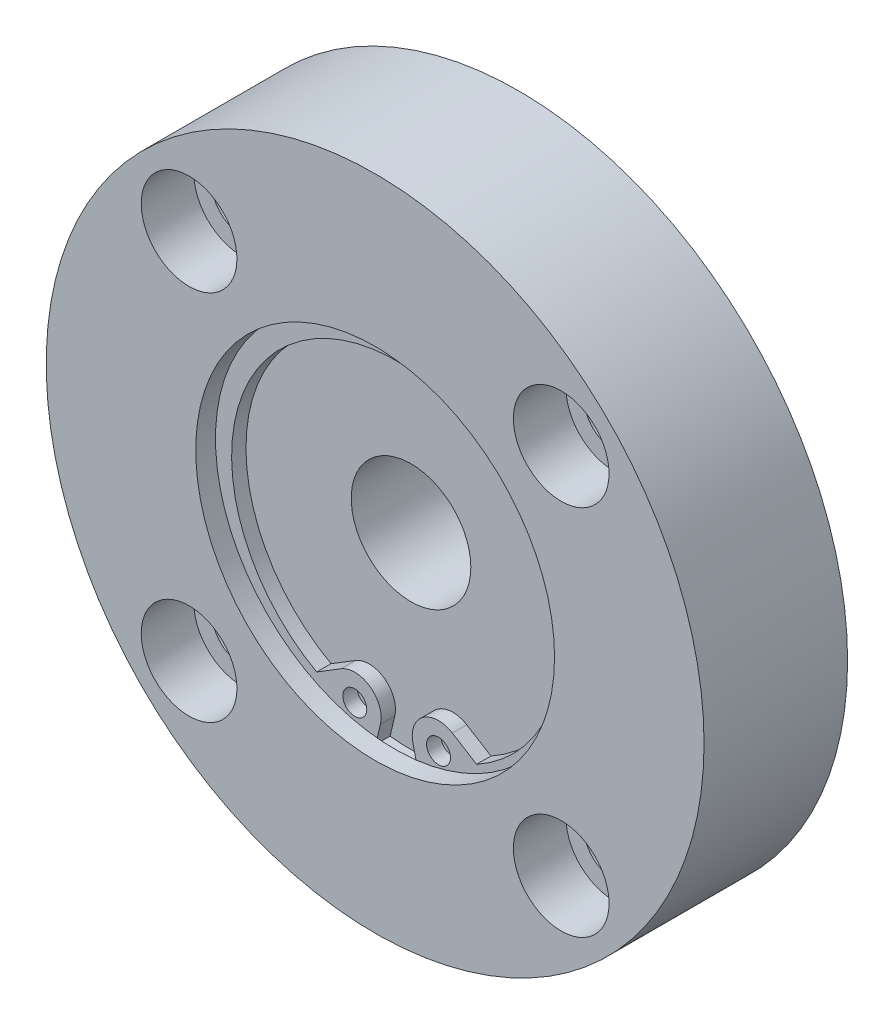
ISO-10303-21;
HEADER;
FILE_DESCRIPTION(('STEP AP214'),'2;1');
FILE_NAME('part.step','',(''),(''),'','','');
FILE_SCHEMA(('AUTOMOTIVE_DESIGN { 1 0 10303 214 1 1 1 1 }'));
ENDSEC;
DATA;
#1=APPLICATION_CONTEXT('core data for automotive mechanical design processes');
#2=APPLICATION_PROTOCOL_DEFINITION('international standard','automotive_design',2000,#1);
#3=PRODUCT_CONTEXT('',#1,'mechanical');
#4=PRODUCT('Part','Part','',(#3));
#5=PRODUCT_RELATED_PRODUCT_CATEGORY('part','',(#4));
#6=PRODUCT_DEFINITION_FORMATION('','',#4);
#7=PRODUCT_DEFINITION_CONTEXT('part definition',#1,'design');
#8=PRODUCT_DEFINITION('design','',#6,#7);
#9=PRODUCT_DEFINITION_SHAPE('','',#8);
#10=(LENGTH_UNIT() NAMED_UNIT(*) SI_UNIT(.MILLI.,.METRE.));
#11=(NAMED_UNIT(*) PLANE_ANGLE_UNIT() SI_UNIT($,.RADIAN.));
#12=(NAMED_UNIT(*) SI_UNIT($,.STERADIAN.) SOLID_ANGLE_UNIT());
#13=UNCERTAINTY_MEASURE_WITH_UNIT(LENGTH_MEASURE(1.E-05),#10,'distance_accuracy_value','');
#14=(GEOMETRIC_REPRESENTATION_CONTEXT(3) GLOBAL_UNCERTAINTY_ASSIGNED_CONTEXT((#13)) GLOBAL_UNIT_ASSIGNED_CONTEXT((#10,
#11,#12)) REPRESENTATION_CONTEXT('',''));
#15=CARTESIAN_POINT('',(0.,0.,0.));
#16=DIRECTION('',(0.,0.,1.));
#17=DIRECTION('',(1.,0.,0.));
#18=AXIS2_PLACEMENT_3D('',#15,#16,#17);
#19=CARTESIAN_POINT('',(15.556349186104,15.5563491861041,0.));
#20=DIRECTION('',(0.,0.,1.));
#21=DIRECTION('',(1.,0.,0.));
#22=AXIS2_PLACEMENT_3D('',#19,#20,#21);
#23=CYLINDRICAL_SURFACE('',#22,2.5);
#24=CARTESIAN_POINT('',(15.556349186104,15.5563491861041,0.));
#25=DIRECTION('',(0.,0.,1.));
#26=DIRECTION('',(1.,0.,0.));
#27=AXIS2_PLACEMENT_3D('',#24,#25,#26);
#28=CIRCLE('',#27,2.5);
#29=CARTESIAN_POINT('',(18.056349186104,15.5563491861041,0.));
#30=VERTEX_POINT('',#29);
#31=EDGE_CURVE('E206',#30,#30,#28,.T.);
#32=ORIENTED_EDGE('',*,*,#31,.F.);
#33=EDGE_LOOP('',(#32));
#34=FACE_BOUND('',#33,.T.);
#35=CARTESIAN_POINT('',(15.556349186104,15.5563491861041,7.6));
#36=DIRECTION('',(0.,0.,1.));
#37=DIRECTION('',(1.,0.,0.));
#38=AXIS2_PLACEMENT_3D('',#35,#36,#37);
#39=CIRCLE('',#38,2.5);
#40=CARTESIAN_POINT('',(18.056349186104,15.5563491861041,7.6));
#41=VERTEX_POINT('',#40);
#42=EDGE_CURVE('E203',#41,#41,#39,.F.);
#43=ORIENTED_EDGE('',*,*,#42,.F.);
#44=EDGE_LOOP('',(#43));
#45=FACE_BOUND('',#44,.T.);
#46=ADVANCED_FACE('F14',(#34,#45),#23,.F.);
#47=CARTESIAN_POINT('',(15.556349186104,-15.556349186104,0.));
#48=DIRECTION('',(0.,0.,1.));
#49=DIRECTION('',(1.,0.,0.));
#50=AXIS2_PLACEMENT_3D('',#47,#48,#49);
#51=CYLINDRICAL_SURFACE('',#50,2.5);
#52=CARTESIAN_POINT('',(15.556349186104,-15.556349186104,0.));
#53=DIRECTION('',(0.,0.,1.));
#54=DIRECTION('',(0.,-1.,0.));
#55=AXIS2_PLACEMENT_3D('',#52,#53,#54);
#56=CIRCLE('',#55,2.5);
#57=CARTESIAN_POINT('',(15.556349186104,-18.056349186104,0.));
#58=VERTEX_POINT('',#57);
#59=EDGE_CURVE('E224',#58,#58,#56,.T.);
#60=ORIENTED_EDGE('',*,*,#59,.F.);
#61=EDGE_LOOP('',(#60));
#62=FACE_BOUND('',#61,.T.);
#63=CARTESIAN_POINT('',(15.556349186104,-15.556349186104,7.6));
#64=DIRECTION('',(0.,0.,1.));
#65=DIRECTION('',(1.,0.,0.));
#66=AXIS2_PLACEMENT_3D('',#63,#64,#65);
#67=CIRCLE('',#66,2.5);
#68=CARTESIAN_POINT('',(18.056349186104,-15.556349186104,7.6));
#69=VERTEX_POINT('',#68);
#70=EDGE_CURVE('E198',#69,#69,#67,.F.);
#71=ORIENTED_EDGE('',*,*,#70,.F.);
#72=EDGE_LOOP('',(#71));
#73=FACE_BOUND('',#72,.T.);
#74=ADVANCED_FACE('F326',(#62,#73),#51,.F.);
#75=CARTESIAN_POINT('',(-15.5563491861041,-15.556349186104,0.));
#76=DIRECTION('',(0.,0.,1.));
#77=DIRECTION('',(1.,0.,0.));
#78=AXIS2_PLACEMENT_3D('',#75,#76,#77);
#79=CYLINDRICAL_SURFACE('',#78,2.5);
#80=CARTESIAN_POINT('',(-15.5563491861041,-15.556349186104,0.));
#81=DIRECTION('',(0.,0.,1.));
#82=DIRECTION('',(-1.,0.,0.));
#83=AXIS2_PLACEMENT_3D('',#80,#81,#82);
#84=CIRCLE('',#83,2.5);
#85=CARTESIAN_POINT('',(-18.0563491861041,-15.556349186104,0.));
#86=VERTEX_POINT('',#85);
#87=EDGE_CURVE('E227',#86,#86,#84,.T.);
#88=ORIENTED_EDGE('',*,*,#87,.F.);
#89=EDGE_LOOP('',(#88));
#90=FACE_BOUND('',#89,.T.);
#91=CARTESIAN_POINT('',(-15.5563491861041,-15.556349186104,7.6));
#92=DIRECTION('',(0.,0.,1.));
#93=DIRECTION('',(1.,0.,0.));
#94=AXIS2_PLACEMENT_3D('',#91,#92,#93);
#95=CIRCLE('',#94,2.5);
#96=CARTESIAN_POINT('',(-13.0563491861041,-15.556349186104,7.6));
#97=VERTEX_POINT('',#96);
#98=EDGE_CURVE('E193',#97,#97,#95,.F.);
#99=ORIENTED_EDGE('',*,*,#98,.F.);
#100=EDGE_LOOP('',(#99));
#101=FACE_BOUND('',#100,.T.);
#102=ADVANCED_FACE('F319',(#90,#101),#79,.F.);
#103=CARTESIAN_POINT('',(-15.556349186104,15.5563491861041,0.));
#104=DIRECTION('',(0.,0.,1.));
#105=DIRECTION('',(1.,0.,0.));
#106=AXIS2_PLACEMENT_3D('',#103,#104,#105);
#107=CYLINDRICAL_SURFACE('',#106,2.5);
#108=CARTESIAN_POINT('',(-15.556349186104,15.5563491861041,0.));
#109=DIRECTION('',(0.,0.,1.));
#110=DIRECTION('',(0.,1.,0.));
#111=AXIS2_PLACEMENT_3D('',#108,#109,#110);
#112=CIRCLE('',#111,2.5);
#113=CARTESIAN_POINT('',(-15.5563491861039,18.0563491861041,0.));
#114=VERTEX_POINT('',#113);
#115=EDGE_CURVE('E201',#114,#114,#112,.T.);
#116=ORIENTED_EDGE('',*,*,#115,.F.);
#117=EDGE_LOOP('',(#116));
#118=FACE_BOUND('',#117,.T.);
#119=CARTESIAN_POINT('',(-15.556349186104,15.5563491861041,7.6));
#120=DIRECTION('',(0.,0.,1.));
#121=DIRECTION('',(1.,0.,0.));
#122=AXIS2_PLACEMENT_3D('',#119,#120,#121);
#123=CIRCLE('',#122,2.5);
#124=CARTESIAN_POINT('',(-13.056349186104,15.5563491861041,7.6));
#125=VERTEX_POINT('',#124);
#126=EDGE_CURVE('E188',#125,#125,#123,.F.);
#127=ORIENTED_EDGE('',*,*,#126,.F.);
#128=EDGE_LOOP('',(#127));
#129=FACE_BOUND('',#128,.T.);
#130=ADVANCED_FACE('F312',(#118,#129),#107,.F.);
#131=CARTESIAN_POINT('',(0.,0.,-5.));
#132=DIRECTION('',(0.,0.,1.));
#133=DIRECTION('',(1.,0.,0.));
#134=AXIS2_PLACEMENT_3D('',#131,#132,#133);
#135=CYLINDRICAL_SURFACE('',#134,18.);
#136=CARTESIAN_POINT('',(0.,0.,-5.));
#137=DIRECTION('',(0.,0.,-1.));
#138=DIRECTION('',(-1.,0.,0.));
#139=AXIS2_PLACEMENT_3D('',#136,#137,#138);
#140=CIRCLE('',#139,18.);
#141=CARTESIAN_POINT('',(-18.,0.,-5.));
#142=VERTEX_POINT('',#141);
#143=EDGE_CURVE('E246',#142,#142,#140,.T.);
#144=ORIENTED_EDGE('',*,*,#143,.F.);
#145=EDGE_LOOP('',(#144));
#146=FACE_BOUND('',#145,.T.);
#147=CARTESIAN_POINT('',(0.,0.,0.));
#148=DIRECTION('',(0.,0.,-1.));
#149=DIRECTION('',(-1.,0.,0.));
#150=AXIS2_PLACEMENT_3D('',#147,#148,#149);
#151=CIRCLE('',#150,18.);
#152=CARTESIAN_POINT('',(-18.,0.,0.));
#153=VERTEX_POINT('',#152);
#154=EDGE_CURVE('E177',#153,#153,#151,.T.);
#155=ORIENTED_EDGE('',*,*,#154,.T.);
#156=EDGE_LOOP('',(#155));
#157=FACE_BOUND('',#156,.T.);
#158=ADVANCED_FACE('F306',(#146,#157),#135,.T.);
#159=CARTESIAN_POINT('',(0.,0.,0.));
#160=DIRECTION('',(0.,0.,1.));
#161=DIRECTION('',(1.,0.,0.));
#162=AXIS2_PLACEMENT_3D('',#159,#160,#161);
#163=PLANE('',#162);
#164=ORIENTED_EDGE('',*,*,#115,.T.);
#165=EDGE_LOOP('',(#164));
#166=FACE_BOUND('',#165,.T.);
#167=ORIENTED_EDGE('',*,*,#87,.T.);
#168=EDGE_LOOP('',(#167));
#169=FACE_BOUND('',#168,.T.);
#170=ORIENTED_EDGE('',*,*,#59,.T.);
#171=EDGE_LOOP('',(#170));
#172=FACE_BOUND('',#171,.T.);
#173=ORIENTED_EDGE('',*,*,#31,.T.);
#174=EDGE_LOOP('',(#173));
#175=FACE_BOUND('',#174,.T.);
#176=CARTESIAN_POINT('',(0.,0.,0.));
#177=DIRECTION('',(0.,0.,1.));
#178=DIRECTION('',(1.,0.,0.));
#179=AXIS2_PLACEMENT_3D('',#176,#177,#178);
#180=CIRCLE('',#179,27.5);
#181=CARTESIAN_POINT('',(27.5,0.,0.));
#182=VERTEX_POINT('',#181);
#183=EDGE_CURVE('E211',#182,#182,#180,.T.);
#184=ORIENTED_EDGE('',*,*,#183,.F.);
#185=EDGE_LOOP('',(#184));
#186=FACE_BOUND('',#185,.T.);
#187=ORIENTED_EDGE('',*,*,#154,.F.);
#188=EDGE_LOOP('',(#187));
#189=FACE_BOUND('',#188,.T.);
#190=ADVANCED_FACE('F302',(#166,#169,#172,#175,#186,#189),#163,.F.);
#191=CARTESIAN_POINT('',(15.556349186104,15.5563491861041,7.6));
#192=DIRECTION('',(0.,0.,1.));
#193=DIRECTION('',(1.,0.,0.));
#194=AXIS2_PLACEMENT_3D('',#191,#192,#193);
#195=PLANE('',#194);
#196=CARTESIAN_POINT('',(15.556349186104,15.5563491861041,7.6));
#197=DIRECTION('',(0.,0.,1.));
#198=DIRECTION('',(1.,0.,0.));
#199=AXIS2_PLACEMENT_3D('',#196,#197,#198);
#200=CIRCLE('',#199,4.);
#201=CARTESIAN_POINT('',(19.556349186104,15.5563491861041,7.6));
#202=VERTEX_POINT('',#201);
#203=EDGE_CURVE('E207',#202,#202,#200,.T.);
#204=ORIENTED_EDGE('',*,*,#203,.T.);
#205=EDGE_LOOP('',(#204));
#206=FACE_BOUND('',#205,.T.);
#207=ORIENTED_EDGE('',*,*,#42,.T.);
#208=EDGE_LOOP('',(#207));
#209=FACE_BOUND('',#208,.T.);
#210=ADVANCED_FACE('F305',(#206,#209),#195,.T.);
#211=CARTESIAN_POINT('',(15.556349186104,-15.556349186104,7.6));
#212=DIRECTION('',(0.,0.,1.));
#213=DIRECTION('',(0.,-1.,0.));
#214=AXIS2_PLACEMENT_3D('',#211,#212,#213);
#215=PLANE('',#214);
#216=CARTESIAN_POINT('',(15.556349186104,-15.556349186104,7.6));
#217=DIRECTION('',(0.,0.,1.));
#218=DIRECTION('',(0.,-1.,0.));
#219=AXIS2_PLACEMENT_3D('',#216,#217,#218);
#220=CIRCLE('',#219,4.);
#221=CARTESIAN_POINT('',(15.556349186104,-19.556349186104,7.6));
#222=VERTEX_POINT('',#221);
#223=EDGE_CURVE('E202',#222,#222,#220,.T.);
#224=ORIENTED_EDGE('',*,*,#223,.T.);
#225=EDGE_LOOP('',(#224));
#226=FACE_BOUND('',#225,.T.);
#227=ORIENTED_EDGE('',*,*,#70,.T.);
#228=EDGE_LOOP('',(#227));
#229=FACE_BOUND('',#228,.T.);
#230=ADVANCED_FACE('F640',(#226,#229),#215,.T.);
#231=CARTESIAN_POINT('',(-15.5563491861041,-15.556349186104,7.6));
#232=DIRECTION('',(0.,0.,1.));
#233=DIRECTION('',(-1.,0.,0.));
#234=AXIS2_PLACEMENT_3D('',#231,#232,#233);
#235=PLANE('',#234);
#236=CARTESIAN_POINT('',(-15.5563491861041,-15.556349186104,7.6));
#237=DIRECTION('',(0.,0.,1.));
#238=DIRECTION('',(-1.,0.,0.));
#239=AXIS2_PLACEMENT_3D('',#236,#237,#238);
#240=CIRCLE('',#239,4.);
#241=CARTESIAN_POINT('',(-19.5563491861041,-15.556349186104,7.6));
#242=VERTEX_POINT('',#241);
#243=EDGE_CURVE('E197',#242,#242,#240,.T.);
#244=ORIENTED_EDGE('',*,*,#243,.T.);
#245=EDGE_LOOP('',(#244));
#246=FACE_BOUND('',#245,.T.);
#247=ORIENTED_EDGE('',*,*,#98,.T.);
#248=EDGE_LOOP('',(#247));
#249=FACE_BOUND('',#248,.T.);
#250=ADVANCED_FACE('F431',(#246,#249),#235,.T.);
#251=CARTESIAN_POINT('',(-15.556349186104,15.5563491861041,7.6));
#252=DIRECTION('',(0.,0.,1.));
#253=DIRECTION('',(0.,1.,0.));
#254=AXIS2_PLACEMENT_3D('',#251,#252,#253);
#255=PLANE('',#254);
#256=CARTESIAN_POINT('',(-15.556349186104,15.5563491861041,7.6));
#257=DIRECTION('',(0.,0.,1.));
#258=DIRECTION('',(0.,1.,0.));
#259=AXIS2_PLACEMENT_3D('',#256,#257,#258);
#260=CIRCLE('',#259,4.);
#261=CARTESIAN_POINT('',(-15.5563491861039,19.5563491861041,7.6));
#262=VERTEX_POINT('',#261);
#263=EDGE_CURVE('E192',#262,#262,#260,.T.);
#264=ORIENTED_EDGE('',*,*,#263,.T.);
#265=EDGE_LOOP('',(#264));
#266=FACE_BOUND('',#265,.T.);
#267=ORIENTED_EDGE('',*,*,#126,.T.);
#268=EDGE_LOOP('',(#267));
#269=FACE_BOUND('',#268,.T.);
#270=ADVANCED_FACE('F426',(#266,#269),#255,.T.);
#271=CARTESIAN_POINT('',(0.,0.,-5.));
#272=DIRECTION('',(0.,0.,-1.));
#273=DIRECTION('',(-1.,0.,0.));
#274=AXIS2_PLACEMENT_3D('',#271,#272,#273);
#275=PLANE('',#274);
#276=ORIENTED_EDGE('',*,*,#143,.T.);
#277=EDGE_LOOP('',(#276));
#278=FACE_BOUND('',#277,.T.);
#279=CARTESIAN_POINT('',(0.,0.,-5.));
#280=DIRECTION('',(0.,0.,-1.));
#281=DIRECTION('',(-1.,0.,0.));
#282=AXIS2_PLACEMENT_3D('',#279,#280,#281);
#283=CIRCLE('',#282,12.);
#284=CARTESIAN_POINT('',(-12.,0.,-5.));
#285=VERTEX_POINT('',#284);
#286=EDGE_CURVE('E249',#285,#285,#283,.T.);
#287=ORIENTED_EDGE('',*,*,#286,.F.);
#288=EDGE_LOOP('',(#287));
#289=FACE_BOUND('',#288,.T.);
#290=ADVANCED_FACE('F298',(#278,#289),#275,.T.);
#291=CARTESIAN_POINT('',(0.,0.,12.));
#292=DIRECTION('',(0.,0.,-1.));
#293=DIRECTION('',(-1.,0.,0.));
#294=AXIS2_PLACEMENT_3D('',#291,#292,#293);
#295=CYLINDRICAL_SURFACE('',#294,27.5);
#296=CARTESIAN_POINT('',(0.,0.,12.));
#297=DIRECTION('',(0.,0.,1.));
#298=DIRECTION('',(1.,0.,0.));
#299=AXIS2_PLACEMENT_3D('',#296,#297,#298);
#300=CIRCLE('',#299,27.5);
#301=CARTESIAN_POINT('',(27.5,0.,12.));
#302=VERTEX_POINT('',#301);
#303=EDGE_CURVE('E208',#302,#302,#300,.T.);
#304=ORIENTED_EDGE('',*,*,#303,.F.);
#305=EDGE_LOOP('',(#304));
#306=FACE_BOUND('',#305,.T.);
#307=ORIENTED_EDGE('',*,*,#183,.T.);
#308=EDGE_LOOP('',(#307));
#309=FACE_BOUND('',#308,.T.);
#310=ADVANCED_FACE('F294',(#306,#309),#295,.T.);
#311=CARTESIAN_POINT('',(15.556349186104,15.5563491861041,7.6));
#312=DIRECTION('',(0.,0.,1.));
#313=DIRECTION('',(1.,0.,0.));
#314=AXIS2_PLACEMENT_3D('',#311,#312,#313);
#315=CYLINDRICAL_SURFACE('',#314,4.);
#316=ORIENTED_EDGE('',*,*,#203,.F.);
#317=EDGE_LOOP('',(#316));
#318=FACE_BOUND('',#317,.T.);
#319=CARTESIAN_POINT('',(15.556349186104,15.5563491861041,12.));
#320=DIRECTION('',(0.,0.,1.));
#321=DIRECTION('',(1.,0.,0.));
#322=AXIS2_PLACEMENT_3D('',#319,#320,#321);
#323=CIRCLE('',#322,4.);
#324=CARTESIAN_POINT('',(19.556349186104,15.5563491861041,12.));
#325=VERTEX_POINT('',#324);
#326=EDGE_CURVE('E221',#325,#325,#323,.T.);
#327=ORIENTED_EDGE('',*,*,#326,.T.);
#328=EDGE_LOOP('',(#327));
#329=FACE_BOUND('',#328,.T.);
#330=ADVANCED_FACE('F297',(#318,#329),#315,.F.);
#331=CARTESIAN_POINT('',(15.556349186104,-15.556349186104,7.6));
#332=DIRECTION('',(0.,0.,1.));
#333=DIRECTION('',(1.,0.,0.));
#334=AXIS2_PLACEMENT_3D('',#331,#332,#333);
#335=CYLINDRICAL_SURFACE('',#334,4.);
#336=ORIENTED_EDGE('',*,*,#223,.F.);
#337=EDGE_LOOP('',(#336));
#338=FACE_BOUND('',#337,.T.);
#339=CARTESIAN_POINT('',(15.556349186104,-15.556349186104,12.));
#340=DIRECTION('',(0.,0.,1.));
#341=DIRECTION('',(0.,-1.,0.));
#342=AXIS2_PLACEMENT_3D('',#339,#340,#341);
#343=CIRCLE('',#342,4.);
#344=CARTESIAN_POINT('',(15.556349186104,-19.556349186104,12.));
#345=VERTEX_POINT('',#344);
#346=EDGE_CURVE('E196',#345,#345,#343,.T.);
#347=ORIENTED_EDGE('',*,*,#346,.T.);
#348=EDGE_LOOP('',(#347));
#349=FACE_BOUND('',#348,.T.);
#350=ADVANCED_FACE('F649',(#338,#349),#335,.F.);
#351=CARTESIAN_POINT('',(-15.5563491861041,-15.556349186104,7.6));
#352=DIRECTION('',(0.,0.,1.));
#353=DIRECTION('',(1.,0.,0.));
#354=AXIS2_PLACEMENT_3D('',#351,#352,#353);
#355=CYLINDRICAL_SURFACE('',#354,4.);
#356=ORIENTED_EDGE('',*,*,#243,.F.);
#357=EDGE_LOOP('',(#356));
#358=FACE_BOUND('',#357,.T.);
#359=CARTESIAN_POINT('',(-15.5563491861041,-15.556349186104,12.));
#360=DIRECTION('',(0.,0.,1.));
#361=DIRECTION('',(-1.,0.,0.));
#362=AXIS2_PLACEMENT_3D('',#359,#360,#361);
#363=CIRCLE('',#362,4.);
#364=CARTESIAN_POINT('',(-19.5563491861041,-15.556349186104,12.));
#365=VERTEX_POINT('',#364);
#366=EDGE_CURVE('E191',#365,#365,#363,.T.);
#367=ORIENTED_EDGE('',*,*,#366,.T.);
#368=EDGE_LOOP('',(#367));
#369=FACE_BOUND('',#368,.T.);
#370=ADVANCED_FACE('F631',(#358,#369),#355,.F.);
#371=CARTESIAN_POINT('',(-15.556349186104,15.5563491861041,7.6));
#372=DIRECTION('',(0.,0.,1.));
#373=DIRECTION('',(1.,0.,0.));
#374=AXIS2_PLACEMENT_3D('',#371,#372,#373);
#375=CYLINDRICAL_SURFACE('',#374,4.);
#376=ORIENTED_EDGE('',*,*,#263,.F.);
#377=EDGE_LOOP('',(#376));
#378=FACE_BOUND('',#377,.T.);
#379=CARTESIAN_POINT('',(-15.556349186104,15.5563491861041,12.));
#380=DIRECTION('',(0.,0.,1.));
#381=DIRECTION('',(0.,1.,0.));
#382=AXIS2_PLACEMENT_3D('',#379,#380,#381);
#383=CIRCLE('',#382,4.);
#384=CARTESIAN_POINT('',(-15.5563491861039,19.5563491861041,12.));
#385=VERTEX_POINT('',#384);
#386=EDGE_CURVE('E186',#385,#385,#383,.T.);
#387=ORIENTED_EDGE('',*,*,#386,.T.);
#388=EDGE_LOOP('',(#387));
#389=FACE_BOUND('',#388,.T.);
#390=ADVANCED_FACE('F423',(#378,#389),#375,.F.);
#391=CARTESIAN_POINT('',(0.,0.,-5.));
#392=DIRECTION('',(0.,0.,1.));
#393=DIRECTION('',(1.,0.,0.));
#394=AXIS2_PLACEMENT_3D('',#391,#392,#393);
#395=CYLINDRICAL_SURFACE('',#394,12.);
#396=ORIENTED_EDGE('',*,*,#286,.T.);
#397=EDGE_LOOP('',(#396));
#398=FACE_BOUND('',#397,.T.);
#399=CARTESIAN_POINT('',(0.,0.,0.));
#400=DIRECTION('',(0.,0.,-1.));
#401=DIRECTION('',(-1.,0.,0.));
#402=AXIS2_PLACEMENT_3D('',#399,#400,#401);
#403=CIRCLE('',#402,12.);
#404=CARTESIAN_POINT('',(-12.,0.,0.));
#405=VERTEX_POINT('',#404);
#406=EDGE_CURVE('E181',#405,#405,#403,.T.);
#407=ORIENTED_EDGE('',*,*,#406,.F.);
#408=EDGE_LOOP('',(#407));
#409=FACE_BOUND('',#408,.T.);
#410=ADVANCED_FACE('F282',(#398,#409),#395,.F.);
#411=CARTESIAN_POINT('',(0.,0.,12.));
#412=DIRECTION('',(0.,0.,1.));
#413=DIRECTION('',(1.,0.,0.));
#414=AXIS2_PLACEMENT_3D('',#411,#412,#413);
#415=PLANE('',#414);
#416=CARTESIAN_POINT('',(0.,0.,12.));
#417=DIRECTION('',(0.,0.,1.));
#418=DIRECTION('',(1.,0.,0.));
#419=AXIS2_PLACEMENT_3D('',#416,#417,#418);
#420=CIRCLE('',#419,15.);
#421=CARTESIAN_POINT('',(15.,0.,12.));
#422=VERTEX_POINT('',#421);
#423=EDGE_CURVE('E187',#422,#422,#420,.T.);
#424=ORIENTED_EDGE('',*,*,#423,.F.);
#425=EDGE_LOOP('',(#424));
#426=FACE_BOUND('',#425,.T.);
#427=ORIENTED_EDGE('',*,*,#386,.F.);
#428=EDGE_LOOP('',(#427));
#429=FACE_BOUND('',#428,.T.);
#430=ORIENTED_EDGE('',*,*,#366,.F.);
#431=EDGE_LOOP('',(#430));
#432=FACE_BOUND('',#431,.T.);
#433=ORIENTED_EDGE('',*,*,#346,.F.);
#434=EDGE_LOOP('',(#433));
#435=FACE_BOUND('',#434,.T.);
#436=ORIENTED_EDGE('',*,*,#326,.F.);
#437=EDGE_LOOP('',(#436));
#438=FACE_BOUND('',#437,.T.);
#439=ORIENTED_EDGE('',*,*,#303,.T.);
#440=EDGE_LOOP('',(#439));
#441=FACE_BOUND('',#440,.T.);
#442=ADVANCED_FACE('F279',(#426,#429,#432,#435,#438,#441),#415,.T.);
#443=ORIENTED_EDGE('',*,*,#406,.T.);
#444=EDGE_LOOP('',(#443));
#445=FACE_BOUND('',#444,.T.);
#446=CARTESIAN_POINT('',(0.,0.,0.));
#447=DIRECTION('',(0.,0.,1.));
#448=DIRECTION('',(1.,0.,0.));
#449=AXIS2_PLACEMENT_3D('',#446,#447,#448);
#450=CIRCLE('',#449,5.);
#451=CARTESIAN_POINT('',(5.,0.,0.));
#452=VERTEX_POINT('',#451);
#453=EDGE_CURVE('E214',#452,#452,#450,.T.);
#454=ORIENTED_EDGE('',*,*,#453,.T.);
#455=EDGE_LOOP('',(#454));
#456=FACE_BOUND('',#455,.T.);
#457=ADVANCED_FACE('F275',(#445,#456),#163,.F.);
#458=CARTESIAN_POINT('',(0.,0.,9.));
#459=DIRECTION('',(0.,0.,1.));
#460=DIRECTION('',(1.,0.,0.));
#461=AXIS2_PLACEMENT_3D('',#458,#459,#460);
#462=CYLINDRICAL_SURFACE('',#461,15.);
#463=CARTESIAN_POINT('',(0.,0.,10.35));
#464=DIRECTION('',(0.,0.,1.));
#465=DIRECTION('',(1.,0.,0.));
#466=AXIS2_PLACEMENT_3D('',#463,#464,#465);
#467=CIRCLE('',#466,15.);
#468=CARTESIAN_POINT('',(15.,0.,10.35));
#469=VERTEX_POINT('',#468);
#470=EDGE_CURVE('E178',#469,#469,#467,.F.);
#471=ORIENTED_EDGE('',*,*,#470,.T.);
#472=EDGE_LOOP('',(#471));
#473=FACE_BOUND('',#472,.T.);
#474=ORIENTED_EDGE('',*,*,#423,.T.);
#475=EDGE_LOOP('',(#474));
#476=FACE_BOUND('',#475,.T.);
#477=ADVANCED_FACE('F271',(#473,#476),#462,.F.);
#478=CARTESIAN_POINT('',(0.,0.,12.));
#479=DIRECTION('',(0.,0.,-1.));
#480=DIRECTION('',(-1.,0.,0.));
#481=AXIS2_PLACEMENT_3D('',#478,#479,#480);
#482=CYLINDRICAL_SURFACE('',#481,5.);
#483=ORIENTED_EDGE('',*,*,#453,.F.);
#484=EDGE_LOOP('',(#483));
#485=FACE_BOUND('',#484,.T.);
#486=CARTESIAN_POINT('',(0.,0.,9.));
#487=DIRECTION('',(0.,0.,1.));
#488=DIRECTION('',(1.,0.,0.));
#489=AXIS2_PLACEMENT_3D('',#486,#487,#488);
#490=CIRCLE('',#489,5.);
#491=CARTESIAN_POINT('',(5.,0.,9.));
#492=VERTEX_POINT('',#491);
#493=EDGE_CURVE('E183',#492,#492,#490,.T.);
#494=ORIENTED_EDGE('',*,*,#493,.T.);
#495=EDGE_LOOP('',(#494));
#496=FACE_BOUND('',#495,.T.);
#497=ADVANCED_FACE('F274',(#485,#496),#482,.F.);
#498=CARTESIAN_POINT('',(0.,0.,9.));
#499=DIRECTION('',(0.,0.,1.));
#500=DIRECTION('',(1.,0.,0.));
#501=AXIS2_PLACEMENT_3D('',#498,#499,#500);
#502=PLANE('',#501);
#503=ORIENTED_EDGE('',*,*,#493,.F.);
#504=EDGE_LOOP('',(#503));
#505=FACE_BOUND('',#504,.T.);
#506=CARTESIAN_POINT('',(0.,0.,9.));
#507=DIRECTION('',(0.,0.,1.));
#508=DIRECTION('',(1.,0.,0.));
#509=AXIS2_PLACEMENT_3D('',#506,#507,#508);
#510=CIRCLE('',#509,15.7);
#511=CARTESIAN_POINT('',(-1.7515909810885,-15.6019847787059,9.));
#512=VERTEX_POINT('',#511);
#513=CARTESIAN_POINT('',(1.75159098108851,-15.6019847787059,9.));
#514=VERTEX_POINT('',#513);
#515=EDGE_CURVE('E116',#512,#514,#510,.T.);
#516=ORIENTED_EDGE('',*,*,#515,.T.);
#517=DIRECTION('',(-0.231349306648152,0.972870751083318,0.));
#518=VECTOR('',#517,1.);
#519=CARTESIAN_POINT('',(-1.85374366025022,-0.440821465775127,9.));
#520=LINE('',#519,#518);
#521=CARTESIAN_POINT('',(1.35968434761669,-13.9539379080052,9.));
#522=VERTEX_POINT('',#521);
#523=EDGE_CURVE('E9',#514,#522,#520,.T.);
#524=ORIENTED_EDGE('',*,*,#523,.T.);
#525=CARTESIAN_POINT('',(3.5,-13.4449694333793,9.));
#526=DIRECTION('',(0.,0.,1.));
#527=DIRECTION('',(1.,0.,0.));
#528=AXIS2_PLACEMENT_3D('',#525,#526,#527);
#529=CIRCLE('',#528,2.2);
#530=CARTESIAN_POINT('',(4.6535366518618,-11.5716426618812,9.));
#531=VERTEX_POINT('',#530);
#532=EDGE_CURVE('E25',#531,#522,#529,.T.);
#533=ORIENTED_EDGE('',*,*,#532,.F.);
#534=DIRECTION('',(0.851512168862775,-0.524334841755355,0.));
#535=VECTOR('',#534,1.);
#536=CARTESIAN_POINT('',(-3.88709507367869,-6.31258595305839,9.));
#537=LINE('',#536,#535);
#538=CARTESIAN_POINT('',(6.68514847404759,-12.8226463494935,9.));
#539=VERTEX_POINT('',#538);
#540=EDGE_CURVE('E144',#531,#539,#537,.T.);
#541=ORIENTED_EDGE('',*,*,#540,.T.);
#542=CARTESIAN_POINT('',(0.,-0.75,9.));
#543=DIRECTION('',(0.,0.,1.));
#544=DIRECTION('',(1.,0.,0.));
#545=AXIS2_PLACEMENT_3D('',#542,#543,#544);
#546=CIRCLE('',#545,13.8);
#547=CARTESIAN_POINT('',(-6.68514847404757,-12.8226463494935,9.));
#548=VERTEX_POINT('',#547);
#549=EDGE_CURVE('E148',#539,#548,#546,.T.);
#550=ORIENTED_EDGE('',*,*,#549,.T.);
#551=DIRECTION('',(0.851512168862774,0.524334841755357,0.));
#552=VECTOR('',#551,1.);
#553=CARTESIAN_POINT('',(3.88709507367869,-6.31258595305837,9.));
#554=LINE('',#553,#552);
#555=CARTESIAN_POINT('',(-4.65353665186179,-11.5716426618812,9.));
#556=VERTEX_POINT('',#555);
#557=EDGE_CURVE('E152',#548,#556,#554,.T.);
#558=ORIENTED_EDGE('',*,*,#557,.T.);
#559=CARTESIAN_POINT('',(-3.5,-13.4449694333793,9.));
#560=DIRECTION('',(0.,0.,1.));
#561=DIRECTION('',(1.,0.,0.));
#562=AXIS2_PLACEMENT_3D('',#559,#560,#561);
#563=CIRCLE('',#562,2.2);
#564=CARTESIAN_POINT('',(-1.35968434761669,-13.9539379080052,9.));
#565=VERTEX_POINT('',#564);
#566=EDGE_CURVE('E159',#565,#556,#563,.T.);
#567=ORIENTED_EDGE('',*,*,#566,.F.);
#568=DIRECTION('',(-0.231349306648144,-0.97287075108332,0.));
#569=VECTOR('',#568,1.);
#570=CARTESIAN_POINT('',(1.85374366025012,-0.440821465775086,9.));
#571=LINE('',#570,#569);
#572=EDGE_CURVE('E156',#565,#512,#571,.T.);
#573=ORIENTED_EDGE('',*,*,#572,.T.);
#574=EDGE_LOOP('',(#516,#524,#533,#541,#550,#558,#567,#573));
#575=FACE_BOUND('',#574,.T.);
#576=ADVANCED_FACE('F267',(#505,#575),#502,.T.);
#577=CARTESIAN_POINT('',(0.,0.,10.35));
#578=DIRECTION('',(0.,0.,1.));
#579=DIRECTION('',(1.,0.,0.));
#580=AXIS2_PLACEMENT_3D('',#577,#578,#579);
#581=PLANE('',#580);
#582=CARTESIAN_POINT('',(0.,0.,10.35));
#583=DIRECTION('',(0.,0.,1.));
#584=DIRECTION('',(1.,0.,0.));
#585=AXIS2_PLACEMENT_3D('',#582,#583,#584);
#586=CIRCLE('',#585,15.7);
#587=CARTESIAN_POINT('',(15.7,0.,10.35));
#588=VERTEX_POINT('',#587);
#589=EDGE_CURVE('E182',#588,#588,#586,.T.);
#590=ORIENTED_EDGE('',*,*,#589,.F.);
#591=EDGE_LOOP('',(#590));
#592=FACE_BOUND('',#591,.T.);
#593=ORIENTED_EDGE('',*,*,#470,.F.);
#594=EDGE_LOOP('',(#593));
#595=FACE_BOUND('',#594,.T.);
#596=ADVANCED_FACE('F264',(#592,#595),#581,.F.);
#597=CARTESIAN_POINT('',(0.,0.,10.35));
#598=DIRECTION('',(0.,0.,-1.));
#599=DIRECTION('',(-1.,0.,0.));
#600=AXIS2_PLACEMENT_3D('',#597,#598,#599);
#601=CYLINDRICAL_SURFACE('',#600,15.7);
#602=ORIENTED_EDGE('',*,*,#589,.T.);
#603=EDGE_LOOP('',(#602));
#604=FACE_BOUND('',#603,.T.);
#605=CARTESIAN_POINT('',(0.,0.,10.2));
#606=DIRECTION('',(0.,0.,-1.));
#607=DIRECTION('',(-1.,0.,0.));
#608=AXIS2_PLACEMENT_3D('',#605,#606,#607);
#609=CIRCLE('',#608,15.7);
#610=CARTESIAN_POINT('',(-1.7515909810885,-15.6019847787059,10.2));
#611=VERTEX_POINT('',#610);
#612=CARTESIAN_POINT('',(1.75159098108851,-15.6019847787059,10.2));
#613=VERTEX_POINT('',#612);
#614=EDGE_CURVE('E172',#611,#613,#609,.T.);
#615=ORIENTED_EDGE('',*,*,#614,.T.);
#616=DIRECTION('',(0.,0.,-1.));
#617=VECTOR('',#616,1.);
#618=CARTESIAN_POINT('',(1.75159098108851,-15.6019847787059,10.35));
#619=LINE('',#618,#617);
#620=EDGE_CURVE('E74',#613,#514,#619,.T.);
#621=ORIENTED_EDGE('',*,*,#620,.T.);
#622=ORIENTED_EDGE('',*,*,#515,.F.);
#623=DIRECTION('',(0.,0.,-1.));
#624=VECTOR('',#623,1.);
#625=CARTESIAN_POINT('',(-1.7515909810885,-15.6019847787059,10.35));
#626=LINE('',#625,#624);
#627=EDGE_CURVE('E174',#512,#611,#626,.F.);
#628=ORIENTED_EDGE('',*,*,#627,.T.);
#629=EDGE_LOOP('',(#615,#621,#622,#628));
#630=FACE_BOUND('',#629,.T.);
#631=ADVANCED_FACE('F261',(#604,#630),#601,.F.);
#632=CARTESIAN_POINT('',(3.5,-13.4449694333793,9.));
#633=DIRECTION('',(0.,0.,1.));
#634=DIRECTION('',(1.,0.,0.));
#635=AXIS2_PLACEMENT_3D('',#632,#633,#634);
#636=CIRCLE('',#635,1.);
#637=CARTESIAN_POINT('',(4.5,-13.4449694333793,9.));
#638=VERTEX_POINT('',#637);
#639=EDGE_CURVE('E167',#638,#638,#636,.T.);
#640=ORIENTED_EDGE('',*,*,#639,.T.);
#641=EDGE_LOOP('',(#640));
#642=FACE_BOUND('',#641,.T.);
#643=ADVANCED_FACE('F415',(#642),#502,.T.);
#644=CARTESIAN_POINT('',(-3.5,-13.4449694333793,9.));
#645=DIRECTION('',(0.,0.,1.));
#646=DIRECTION('',(1.,0.,0.));
#647=AXIS2_PLACEMENT_3D('',#644,#645,#646);
#648=CIRCLE('',#647,1.);
#649=CARTESIAN_POINT('',(-2.5,-13.4449694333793,9.));
#650=VERTEX_POINT('',#649);
#651=EDGE_CURVE('E163',#650,#650,#648,.T.);
#652=ORIENTED_EDGE('',*,*,#651,.T.);
#653=EDGE_LOOP('',(#652));
#654=FACE_BOUND('',#653,.T.);
#655=ADVANCED_FACE('F370',(#654),#502,.T.);
#656=CARTESIAN_POINT('',(4.6535366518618,-11.5716426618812,10.2));
#657=DIRECTION('',(-0.524334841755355,-0.851512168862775,0.));
#658=DIRECTION('',(-0.851512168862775,0.524334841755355,0.));
#659=AXIS2_PLACEMENT_3D('',#656,#657,#658);
#660=PLANE('',#659);
#661=ORIENTED_EDGE('',*,*,#540,.F.);
#662=DIRECTION('',(0.,0.,-1.));
#663=VECTOR('',#662,1.);
#664=CARTESIAN_POINT('',(4.6535366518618,-11.5716426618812,10.2));
#665=LINE('',#664,#663);
#666=CARTESIAN_POINT('',(4.6535366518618,-11.5716426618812,10.2));
#667=VERTEX_POINT('',#666);
#668=EDGE_CURVE('E18',#667,#531,#665,.T.);
#669=ORIENTED_EDGE('',*,*,#668,.F.);
#670=DIRECTION('',(-0.851512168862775,0.524334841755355,0.));
#671=VECTOR('',#670,1.);
#672=CARTESIAN_POINT('',(4.6535366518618,-11.5716426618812,10.2));
#673=LINE('',#672,#671);
#674=CARTESIAN_POINT('',(6.68514847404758,-12.8226463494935,10.2));
#675=VERTEX_POINT('',#674);
#676=EDGE_CURVE('E86',#675,#667,#673,.T.);
#677=ORIENTED_EDGE('',*,*,#676,.F.);
#678=DIRECTION('',(0.,0.,-1.));
#679=VECTOR('',#678,1.);
#680=CARTESIAN_POINT('',(6.68514847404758,-12.8226463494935,10.2));
#681=LINE('',#680,#679);
#682=EDGE_CURVE('E107',#675,#539,#681,.T.);
#683=ORIENTED_EDGE('',*,*,#682,.T.);
#684=EDGE_LOOP('',(#661,#669,#677,#683));
#685=FACE_BOUND('',#684,.T.);
#686=ADVANCED_FACE('F352',(#685),#660,.F.);
#687=CARTESIAN_POINT('',(0.,-0.75,10.2));
#688=DIRECTION('',(0.,0.,1.));
#689=DIRECTION('',(-1.,0.,0.));
#690=AXIS2_PLACEMENT_3D('',#687,#688,#689);
#691=CYLINDRICAL_SURFACE('',#690,13.8);
#692=ORIENTED_EDGE('',*,*,#549,.F.);
#693=ORIENTED_EDGE('',*,*,#682,.F.);
#694=CARTESIAN_POINT('',(0.,-0.75,10.2));
#695=DIRECTION('',(0.,0.,-1.));
#696=DIRECTION('',(0.,-1.,0.));
#697=AXIS2_PLACEMENT_3D('',#694,#695,#696);
#698=CIRCLE('',#697,13.8);
#699=CARTESIAN_POINT('',(-6.68514847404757,-12.8226463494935,10.2));
#700=VERTEX_POINT('',#699);
#701=EDGE_CURVE('E102',#700,#675,#698,.T.);
#702=ORIENTED_EDGE('',*,*,#701,.F.);
#703=DIRECTION('',(0.,0.,-1.));
#704=VECTOR('',#703,1.);
#705=CARTESIAN_POINT('',(-6.68514847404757,-12.8226463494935,10.2));
#706=LINE('',#705,#704);
#707=EDGE_CURVE('E110',#700,#548,#706,.T.);
#708=ORIENTED_EDGE('',*,*,#707,.T.);
#709=EDGE_LOOP('',(#692,#693,#702,#708));
#710=FACE_BOUND('',#709,.T.);
#711=ADVANCED_FACE('F355',(#710),#691,.F.);
#712=CARTESIAN_POINT('',(-4.65353665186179,-11.5716426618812,10.2));
#713=DIRECTION('',(0.524334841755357,-0.851512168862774,0.));
#714=DIRECTION('',(0.,0.,-1.));
#715=AXIS2_PLACEMENT_3D('',#712,#713,#714);
#716=PLANE('',#715);
#717=ORIENTED_EDGE('',*,*,#557,.F.);
#718=ORIENTED_EDGE('',*,*,#707,.F.);
#719=DIRECTION('',(-0.851512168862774,-0.524334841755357,0.));
#720=VECTOR('',#719,1.);
#721=CARTESIAN_POINT('',(-4.65353665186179,-11.5716426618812,10.2));
#722=LINE('',#721,#720);
#723=CARTESIAN_POINT('',(-4.65353665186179,-11.5716426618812,10.2));
#724=VERTEX_POINT('',#723);
#725=EDGE_CURVE('E111',#724,#700,#722,.T.);
#726=ORIENTED_EDGE('',*,*,#725,.F.);
#727=DIRECTION('',(0.,0.,-1.));
#728=VECTOR('',#727,1.);
#729=CARTESIAN_POINT('',(-4.65353665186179,-11.5716426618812,10.2));
#730=LINE('',#729,#728);
#731=EDGE_CURVE('E113',#724,#556,#730,.T.);
#732=ORIENTED_EDGE('',*,*,#731,.T.);
#733=EDGE_LOOP('',(#717,#718,#726,#732));
#734=FACE_BOUND('',#733,.T.);
#735=ADVANCED_FACE('F347',(#734),#716,.F.);
#736=CARTESIAN_POINT('',(-3.5,-13.4449694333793,10.2));
#737=DIRECTION('',(0.,0.,1.));
#738=DIRECTION('',(-1.,0.,0.));
#739=AXIS2_PLACEMENT_3D('',#736,#737,#738);
#740=CYLINDRICAL_SURFACE('',#739,1.);
#741=ORIENTED_EDGE('',*,*,#651,.F.);
#742=EDGE_LOOP('',(#741));
#743=FACE_BOUND('',#742,.T.);
#744=CARTESIAN_POINT('',(-3.5,-13.4449694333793,10.2));
#745=DIRECTION('',(0.,0.,-1.));
#746=DIRECTION('',(1.,0.,0.));
#747=AXIS2_PLACEMENT_3D('',#744,#745,#746);
#748=CIRCLE('',#747,1.);
#749=CARTESIAN_POINT('',(-2.5,-13.4449694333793,10.2));
#750=VERTEX_POINT('',#749);
#751=EDGE_CURVE('E96',#750,#750,#748,.T.);
#752=ORIENTED_EDGE('',*,*,#751,.F.);
#753=EDGE_LOOP('',(#752));
#754=FACE_BOUND('',#753,.T.);
#755=ADVANCED_FACE('F344',(#743,#754),#740,.F.);
#756=CARTESIAN_POINT('',(3.5,-13.4449694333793,10.2));
#757=DIRECTION('',(0.,0.,1.));
#758=DIRECTION('',(-1.,0.,0.));
#759=AXIS2_PLACEMENT_3D('',#756,#757,#758);
#760=CYLINDRICAL_SURFACE('',#759,1.);
#761=ORIENTED_EDGE('',*,*,#639,.F.);
#762=EDGE_LOOP('',(#761));
#763=FACE_BOUND('',#762,.T.);
#764=CARTESIAN_POINT('',(3.5,-13.4449694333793,10.2));
#765=DIRECTION('',(0.,0.,1.));
#766=DIRECTION('',(1.,0.,0.));
#767=AXIS2_PLACEMENT_3D('',#764,#765,#766);
#768=CIRCLE('',#767,1.);
#769=CARTESIAN_POINT('',(4.5,-13.4449694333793,10.2));
#770=VERTEX_POINT('',#769);
#771=EDGE_CURVE('E98',#770,#770,#768,.T.);
#772=ORIENTED_EDGE('',*,*,#771,.T.);
#773=EDGE_LOOP('',(#772));
#774=FACE_BOUND('',#773,.T.);
#775=ADVANCED_FACE('F16',(#763,#774),#760,.F.);
#776=CARTESIAN_POINT('',(3.5,-13.4449694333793,10.2));
#777=DIRECTION('',(0.,0.,1.));
#778=DIRECTION('',(-1.,0.,0.));
#779=AXIS2_PLACEMENT_3D('',#776,#777,#778);
#780=CYLINDRICAL_SURFACE('',#779,2.2);
#781=ORIENTED_EDGE('',*,*,#532,.T.);
#782=DIRECTION('',(0.,0.,-1.));
#783=VECTOR('',#782,1.);
#784=CARTESIAN_POINT('',(1.35968434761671,-13.9539379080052,10.2));
#785=LINE('',#784,#783);
#786=CARTESIAN_POINT('',(1.35968434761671,-13.9539379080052,10.2));
#787=VERTEX_POINT('',#786);
#788=EDGE_CURVE('E71',#787,#522,#785,.T.);
#789=ORIENTED_EDGE('',*,*,#788,.F.);
#790=CARTESIAN_POINT('',(3.5,-13.4449694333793,10.2));
#791=DIRECTION('',(0.,0.,1.));
#792=DIRECTION('',(1.,0.,0.));
#793=AXIS2_PLACEMENT_3D('',#790,#791,#792);
#794=CIRCLE('',#793,2.2);
#795=EDGE_CURVE('E79',#667,#787,#794,.T.);
#796=ORIENTED_EDGE('',*,*,#795,.F.);
#797=ORIENTED_EDGE('',*,*,#668,.T.);
#798=EDGE_LOOP('',(#781,#789,#796,#797));
#799=FACE_BOUND('',#798,.T.);
#800=ADVANCED_FACE('F89',(#799),#780,.T.);
#801=CARTESIAN_POINT('',(0.,-0.75,10.2));
#802=DIRECTION('',(0.,0.,-1.));
#803=DIRECTION('',(0.,-1.,0.));
#804=AXIS2_PLACEMENT_3D('',#801,#802,#803);
#805=PLANE('',#804);
#806=ORIENTED_EDGE('',*,*,#771,.F.);
#807=EDGE_LOOP('',(#806));
#808=FACE_BOUND('',#807,.T.);
#809=ORIENTED_EDGE('',*,*,#751,.T.);
#810=EDGE_LOOP('',(#809));
#811=FACE_BOUND('',#810,.T.);
#812=ORIENTED_EDGE('',*,*,#614,.F.);
#813=DIRECTION('',(0.231349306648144,0.97287075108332,0.));
#814=VECTOR('',#813,1.);
#815=CARTESIAN_POINT('',(-1.3596843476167,-13.9539379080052,10.2));
#816=LINE('',#815,#814);
#817=CARTESIAN_POINT('',(-1.3596843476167,-13.9539379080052,10.2));
#818=VERTEX_POINT('',#817);
#819=EDGE_CURVE('E80',#611,#818,#816,.T.);
#820=ORIENTED_EDGE('',*,*,#819,.T.);
#821=CARTESIAN_POINT('',(-3.5,-13.4449694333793,10.2));
#822=DIRECTION('',(0.,0.,1.));
#823=DIRECTION('',(-1.,0.,0.));
#824=AXIS2_PLACEMENT_3D('',#821,#822,#823);
#825=CIRCLE('',#824,2.2);
#826=EDGE_CURVE('E118',#818,#724,#825,.T.);
#827=ORIENTED_EDGE('',*,*,#826,.T.);
#828=ORIENTED_EDGE('',*,*,#725,.T.);
#829=ORIENTED_EDGE('',*,*,#701,.T.);
#830=ORIENTED_EDGE('',*,*,#676,.T.);
#831=ORIENTED_EDGE('',*,*,#795,.T.);
#832=DIRECTION('',(0.231349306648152,-0.972870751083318,0.));
#833=VECTOR('',#832,1.);
#834=CARTESIAN_POINT('',(1.35968434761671,-13.9539379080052,10.2));
#835=LINE('',#834,#833);
#836=EDGE_CURVE('E67',#787,#613,#835,.T.);
#837=ORIENTED_EDGE('',*,*,#836,.T.);
#838=EDGE_LOOP('',(#812,#820,#827,#828,#829,#830,#831,#837));
#839=FACE_BOUND('',#838,.T.);
#840=ADVANCED_FACE('F84',(#808,#811,#839),#805,.F.);
#841=CARTESIAN_POINT('',(-3.5,-13.4449694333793,10.2));
#842=DIRECTION('',(0.,0.,1.));
#843=DIRECTION('',(-1.,0.,0.));
#844=AXIS2_PLACEMENT_3D('',#841,#842,#843);
#845=CYLINDRICAL_SURFACE('',#844,2.2);
#846=ORIENTED_EDGE('',*,*,#566,.T.);
#847=ORIENTED_EDGE('',*,*,#731,.F.);
#848=ORIENTED_EDGE('',*,*,#826,.F.);
#849=DIRECTION('',(0.,0.,-1.));
#850=VECTOR('',#849,1.);
#851=CARTESIAN_POINT('',(-1.3596843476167,-13.9539379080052,10.2));
#852=LINE('',#851,#850);
#853=EDGE_CURVE('E91',#818,#565,#852,.T.);
#854=ORIENTED_EDGE('',*,*,#853,.T.);
#855=EDGE_LOOP('',(#846,#847,#848,#854));
#856=FACE_BOUND('',#855,.T.);
#857=ADVANCED_FACE('F349',(#856),#845,.T.);
#858=CARTESIAN_POINT('',(-1.3596843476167,-13.9539379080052,10.2));
#859=DIRECTION('',(-0.97287075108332,0.231349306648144,0.));
#860=DIRECTION('',(0.,0.,1.));
#861=AXIS2_PLACEMENT_3D('',#858,#859,#860);
#862=PLANE('',#861);
#863=ORIENTED_EDGE('',*,*,#627,.F.);
#864=ORIENTED_EDGE('',*,*,#572,.F.);
#865=ORIENTED_EDGE('',*,*,#853,.F.);
#866=ORIENTED_EDGE('',*,*,#819,.F.);
#867=EDGE_LOOP('',(#863,#864,#865,#866));
#868=FACE_BOUND('',#867,.T.);
#869=ADVANCED_FACE('F357',(#868),#862,.F.);
#870=CARTESIAN_POINT('',(1.35968434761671,-13.9539379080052,10.2));
#871=DIRECTION('',(0.972870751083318,0.231349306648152,0.));
#872=DIRECTION('',(0.,0.,-1.));
#873=AXIS2_PLACEMENT_3D('',#870,#871,#872);
#874=PLANE('',#873);
#875=ORIENTED_EDGE('',*,*,#620,.F.);
#876=ORIENTED_EDGE('',*,*,#836,.F.);
#877=ORIENTED_EDGE('',*,*,#788,.T.);
#878=ORIENTED_EDGE('',*,*,#523,.F.);
#879=EDGE_LOOP('',(#875,#876,#877,#878));
#880=FACE_BOUND('',#879,.T.);
#881=ADVANCED_FACE('F69',(#880),#874,.F.);
#882=CLOSED_SHELL('',(#46,#74,#102,#130,#158,#190,#210,#230,#250,#270,#290,#310,#330,#350,#370,
#390,#410,#442,#457,#477,#497,#576,#596,#631,#643,#655,#686,#711,#735,#755,#775,#800,#840,#857,
#869,#881));
#883=MANIFOLD_SOLID_BREP('B1',#882);
#884=ADVANCED_BREP_SHAPE_REPRESENTATION('',(#18,#883),#14);
#885=SHAPE_DEFINITION_REPRESENTATION(#9,#884);
ENDSEC;
END-ISO-10303-21;
